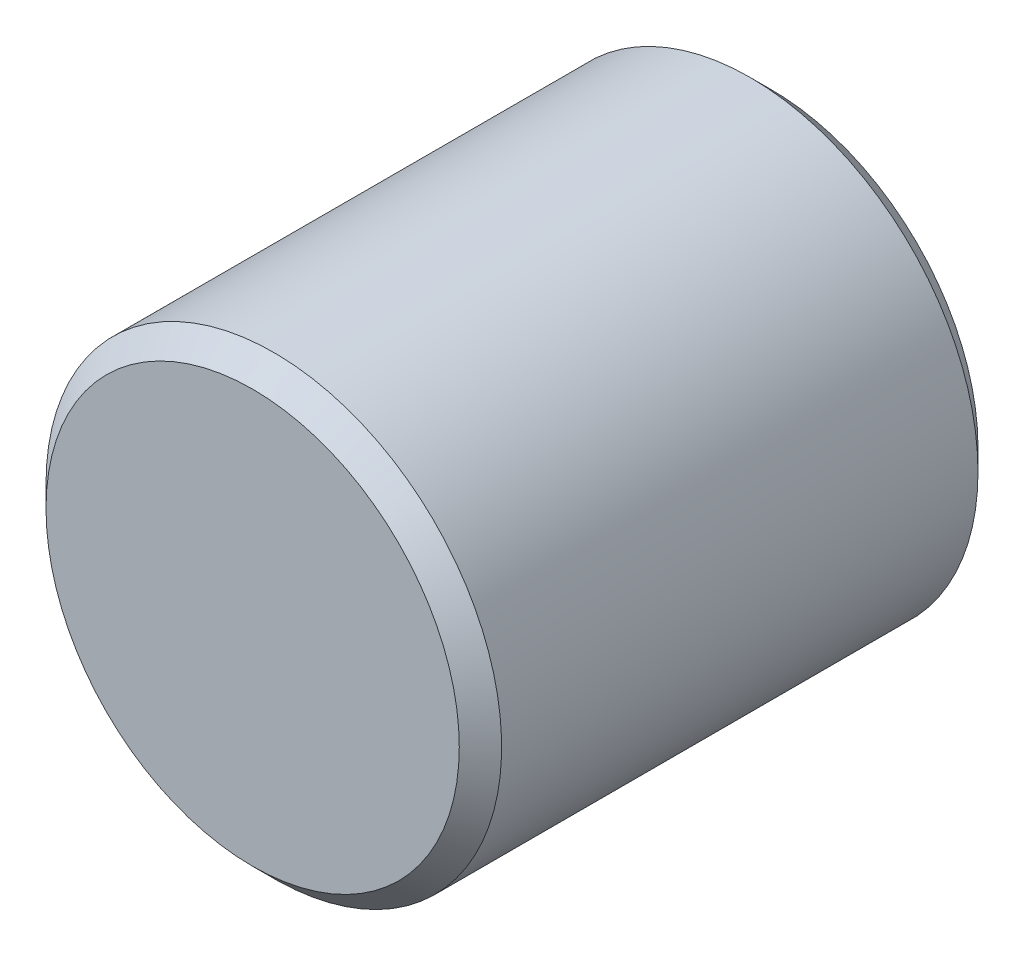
ISO-10303-21;
HEADER;
FILE_DESCRIPTION(('STEP AP214'),'2;1');
FILE_NAME('part.step','',(''),(''),'','','');
FILE_SCHEMA(('AUTOMOTIVE_DESIGN { 1 0 10303 214 1 1 1 1 }'));
ENDSEC;
DATA;
#1=APPLICATION_CONTEXT('core data for automotive mechanical design processes');
#2=APPLICATION_PROTOCOL_DEFINITION('international standard','automotive_design',2000,#1);
#3=PRODUCT_CONTEXT('',#1,'mechanical');
#4=PRODUCT('Part','Part','',(#3));
#5=PRODUCT_RELATED_PRODUCT_CATEGORY('part','',(#4));
#6=PRODUCT_DEFINITION_FORMATION('','',#4);
#7=PRODUCT_DEFINITION_CONTEXT('part definition',#1,'design');
#8=PRODUCT_DEFINITION('design','',#6,#7);
#9=PRODUCT_DEFINITION_SHAPE('','',#8);
#10=(LENGTH_UNIT() NAMED_UNIT(*) SI_UNIT(.MILLI.,.METRE.));
#11=(NAMED_UNIT(*) PLANE_ANGLE_UNIT() SI_UNIT($,.RADIAN.));
#12=(NAMED_UNIT(*) SI_UNIT($,.STERADIAN.) SOLID_ANGLE_UNIT());
#13=UNCERTAINTY_MEASURE_WITH_UNIT(LENGTH_MEASURE(1.E-05),#10,'distance_accuracy_value','');
#14=(GEOMETRIC_REPRESENTATION_CONTEXT(3) GLOBAL_UNCERTAINTY_ASSIGNED_CONTEXT((#13)) GLOBAL_UNIT_ASSIGNED_CONTEXT((#10,
#11,#12)) REPRESENTATION_CONTEXT('',''));
#15=CARTESIAN_POINT('',(0.,0.,0.));
#16=DIRECTION('',(0.,0.,1.));
#17=DIRECTION('',(1.,0.,0.));
#18=AXIS2_PLACEMENT_3D('',#15,#16,#17);
#19=CARTESIAN_POINT('',(0.,0.,15.5575));
#20=DIRECTION('',(0.,0.,-1.));
#21=DIRECTION('',(-1.,0.,0.));
#22=AXIS2_PLACEMENT_3D('',#19,#20,#21);
#23=CYLINDRICAL_SURFACE('',#22,6.8326);
#24=CARTESIAN_POINT('',(0.,0.,0.635000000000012));
#25=DIRECTION('',(0.,0.,1.));
#26=DIRECTION('',(1.,0.,0.));
#27=AXIS2_PLACEMENT_3D('',#24,#25,#26);
#28=CIRCLE('',#27,6.8326);
#29=CARTESIAN_POINT('',(-6.8326,0.,0.635000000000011));
#30=VERTEX_POINT('',#29);
#31=EDGE_CURVE('E43',#30,#30,#28,.T.);
#32=CARTESIAN_POINT('',(0.,0.,14.9225));
#33=DIRECTION('',(0.,0.,1.));
#34=DIRECTION('',(1.,0.,0.));
#35=AXIS2_PLACEMENT_3D('',#32,#33,#34);
#36=CIRCLE('',#35,6.8326);
#37=CARTESIAN_POINT('',(-6.8326,0.,14.9225));
#38=VERTEX_POINT('',#37);
#39=EDGE_CURVE('E47',#38,#38,#36,.F.);
#40=CARTESIAN_POINT('',(-6.8326,0.,0.635000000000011));
#41=CARTESIAN_POINT('',(-6.8326,0.,0.783828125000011));
#42=CARTESIAN_POINT('',(-6.8326,0.,0.932656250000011));
#43=CARTESIAN_POINT('',(-6.8326,0.,1.23031250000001));
#44=CARTESIAN_POINT('',(-6.8326,0.,1.37914062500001));
#45=CARTESIAN_POINT('',(-6.8326,0.,1.67679687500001));
#46=CARTESIAN_POINT('',(-6.8326,0.,1.82562500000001));
#47=CARTESIAN_POINT('',(-6.8326,0.,2.12328125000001));
#48=CARTESIAN_POINT('',(-6.8326,0.,2.27210937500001));
#49=CARTESIAN_POINT('',(-6.8326,0.,2.56976562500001));
#50=CARTESIAN_POINT('',(-6.8326,0.,2.71859375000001));
#51=CARTESIAN_POINT('',(-6.8326,0.,3.01625000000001));
#52=CARTESIAN_POINT('',(-6.8326,0.,3.16507812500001));
#53=CARTESIAN_POINT('',(-6.8326,0.,3.46273437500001));
#54=CARTESIAN_POINT('',(-6.8326,0.,3.61156250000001));
#55=CARTESIAN_POINT('',(-6.8326,0.,3.90921875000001));
#56=CARTESIAN_POINT('',(-6.8326,0.,4.05804687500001));
#57=CARTESIAN_POINT('',(-6.8326,0.,4.35570312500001));
#58=CARTESIAN_POINT('',(-6.8326,0.,4.50453125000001));
#59=CARTESIAN_POINT('',(-6.8326,0.,4.80218750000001));
#60=CARTESIAN_POINT('',(-6.8326,0.,4.95101562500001));
#61=CARTESIAN_POINT('',(-6.8326,0.,5.24867187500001));
#62=CARTESIAN_POINT('',(-6.8326,0.,5.39750000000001));
#63=CARTESIAN_POINT('',(-6.8326,0.,5.69515625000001));
#64=CARTESIAN_POINT('',(-6.8326,0.,5.84398437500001));
#65=CARTESIAN_POINT('',(-6.8326,0.,6.14164062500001));
#66=CARTESIAN_POINT('',(-6.8326,0.,6.29046875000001));
#67=CARTESIAN_POINT('',(-6.8326,0.,6.58812500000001));
#68=CARTESIAN_POINT('',(-6.8326,0.,6.73695312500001));
#69=CARTESIAN_POINT('',(-6.8326,0.,7.03460937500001));
#70=CARTESIAN_POINT('',(-6.8326,0.,7.18343750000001));
#71=CARTESIAN_POINT('',(-6.8326,0.,7.48109375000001));
#72=CARTESIAN_POINT('',(-6.8326,0.,7.62992187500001));
#73=CARTESIAN_POINT('',(-6.8326,0.,7.92757812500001));
#74=CARTESIAN_POINT('',(-6.8326,0.,8.07640625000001));
#75=CARTESIAN_POINT('',(-6.8326,0.,8.37406250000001));
#76=CARTESIAN_POINT('',(-6.8326,0.,8.52289062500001));
#77=CARTESIAN_POINT('',(-6.8326,0.,8.82054687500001));
#78=CARTESIAN_POINT('',(-6.8326,0.,8.96937500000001));
#79=CARTESIAN_POINT('',(-6.8326,0.,9.26703125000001));
#80=CARTESIAN_POINT('',(-6.8326,0.,9.41585937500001));
#81=CARTESIAN_POINT('',(-6.8326,0.,9.71351562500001));
#82=CARTESIAN_POINT('',(-6.8326,0.,9.86234375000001));
#83=CARTESIAN_POINT('',(-6.8326,0.,10.16));
#84=CARTESIAN_POINT('',(-6.8326,0.,10.308828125));
#85=CARTESIAN_POINT('',(-6.8326,0.,10.606484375));
#86=CARTESIAN_POINT('',(-6.8326,0.,10.7553125));
#87=CARTESIAN_POINT('',(-6.8326,0.,11.05296875));
#88=CARTESIAN_POINT('',(-6.8326,0.,11.201796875));
#89=CARTESIAN_POINT('',(-6.8326,0.,11.499453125));
#90=CARTESIAN_POINT('',(-6.8326,0.,11.64828125));
#91=CARTESIAN_POINT('',(-6.8326,0.,11.9459375));
#92=CARTESIAN_POINT('',(-6.8326,0.,12.094765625));
#93=CARTESIAN_POINT('',(-6.8326,0.,12.392421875));
#94=CARTESIAN_POINT('',(-6.8326,0.,12.54125));
#95=CARTESIAN_POINT('',(-6.8326,0.,12.83890625));
#96=CARTESIAN_POINT('',(-6.8326,0.,12.987734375));
#97=CARTESIAN_POINT('',(-6.8326,0.,13.285390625));
#98=CARTESIAN_POINT('',(-6.8326,0.,13.43421875));
#99=CARTESIAN_POINT('',(-6.8326,0.,13.731875));
#100=CARTESIAN_POINT('',(-6.8326,0.,13.880703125));
#101=CARTESIAN_POINT('',(-6.8326,0.,14.178359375));
#102=CARTESIAN_POINT('',(-6.8326,0.,14.3271875));
#103=CARTESIAN_POINT('',(-6.8326,0.,14.62484375));
#104=CARTESIAN_POINT('',(-6.8326,0.,14.773671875));
#105=CARTESIAN_POINT('',(-6.8326,0.,14.9225));
#106=B_SPLINE_CURVE_WITH_KNOTS('',3,(#40,#41,#42,#43,#44,#45,#46,#47,#48,#49,#50,#51,#52,#53,
#54,#55,#56,#57,#58,#59,#60,#61,#62,#63,#64,#65,#66,#67,#68,#69,#70,#71,#72,#73,#74,#75,#76,#77,
#78,#79,#80,#81,#82,#83,#84,#85,#86,#87,#88,#89,#90,#91,#92,#93,#94,#95,#96,#97,#98,#99,#100,
#101,#102,#103,#104,#105),.UNSPECIFIED.,.F.,.F.,(4,2,2,2,2,2,2,2,2,2,2,2,2,2,2,2,2,2,2,2,2,2,2,
2,2,2,2,2,2,2,2,2,4),(0.,0.446484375,0.892968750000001,1.339453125,1.7859375,2.232421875,
2.67890625,3.125390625,3.571875,4.018359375,4.46484375,4.911328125,5.3578125,5.804296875,
6.25078125,6.697265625,7.14375,7.590234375,8.03671875,8.483203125,8.9296875,9.376171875,
9.82265625,10.269140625,10.715625,11.162109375,11.60859375,12.055078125,12.5015625,12.948046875,
13.39453125,13.841015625,14.2875),.UNSPECIFIED.);
#107=EDGE_CURVE('BSEAM32',#30,#38,#106,.T.);
#108=ORIENTED_EDGE('',*,*,#31,.T.);
#109=ORIENTED_EDGE('',*,*,#39,.T.);
#110=ORIENTED_EDGE('',*,*,#107,.T.);
#111=ORIENTED_EDGE('',*,*,#107,.F.);
#112=EDGE_LOOP('',(#108,#110,#109,#111));
#113=FACE_BOUND('',#112,.T.);
#114=ADVANCED_FACE('F32',(#113),#23,.T.);
#115=CARTESIAN_POINT('',(0.,0.,15.5575));
#116=DIRECTION('',(0.,0.,1.));
#117=DIRECTION('',(1.,0.,0.));
#118=AXIS2_PLACEMENT_3D('',#115,#116,#117);
#119=PLANE('',#118);
#120=CARTESIAN_POINT('',(0.,0.,15.5575));
#121=DIRECTION('',(0.,0.,1.));
#122=DIRECTION('',(1.,0.,0.));
#123=AXIS2_PLACEMENT_3D('',#120,#121,#122);
#124=CIRCLE('',#123,6.19760000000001);
#125=CARTESIAN_POINT('',(6.19760000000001,0.,15.5575));
#126=VERTEX_POINT('',#125);
#127=EDGE_CURVE('E10',#126,#126,#124,.T.);
#128=ORIENTED_EDGE('',*,*,#127,.T.);
#129=EDGE_LOOP('',(#128));
#130=FACE_BOUND('',#129,.T.);
#131=ADVANCED_FACE('F63',(#130),#119,.T.);
#132=CARTESIAN_POINT('',(0.,0.,0.));
#133=DIRECTION('',(0.,0.,1.));
#134=DIRECTION('',(1.,0.,0.));
#135=AXIS2_PLACEMENT_3D('',#132,#133,#134);
#136=PLANE('',#135);
#137=CARTESIAN_POINT('',(0.,0.,0.));
#138=DIRECTION('',(0.,0.,1.));
#139=DIRECTION('',(1.,0.,0.));
#140=AXIS2_PLACEMENT_3D('',#137,#138,#139);
#141=CIRCLE('',#140,6.19759999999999);
#142=CARTESIAN_POINT('',(6.19759999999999,0.,0.));
#143=VERTEX_POINT('',#142);
#144=EDGE_CURVE('E39',#143,#143,#141,.F.);
#145=ORIENTED_EDGE('',*,*,#144,.T.);
#146=EDGE_LOOP('',(#145));
#147=FACE_BOUND('',#146,.T.);
#148=ADVANCED_FACE('F60',(#147),#136,.F.);
#149=CARTESIAN_POINT('',(0.,0.,0.635000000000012));
#150=DIRECTION('',(0.,0.,1.));
#151=DIRECTION('',(1.,0.,0.));
#152=AXIS2_PLACEMENT_3D('',#149,#150,#151);
#153=CONICAL_SURFACE('',#152,6.8326,0.785398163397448);
#154=ORIENTED_EDGE('',*,*,#144,.F.);
#155=EDGE_LOOP('',(#154));
#156=FACE_BOUND('',#155,.T.);
#157=ORIENTED_EDGE('',*,*,#31,.F.);
#158=EDGE_LOOP('',(#157));
#159=FACE_BOUND('',#158,.T.);
#160=ADVANCED_FACE('F56',(#156,#159),#153,.T.);
#161=CARTESIAN_POINT('',(0.,0.,15.5575));
#162=DIRECTION('',(0.,0.,-1.));
#163=DIRECTION('',(-1.,0.,0.));
#164=AXIS2_PLACEMENT_3D('',#161,#162,#163);
#165=CONICAL_SURFACE('',#164,6.19760000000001,0.785398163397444);
#166=ORIENTED_EDGE('',*,*,#39,.F.);
#167=EDGE_LOOP('',(#166));
#168=FACE_BOUND('',#167,.T.);
#169=ORIENTED_EDGE('',*,*,#127,.F.);
#170=EDGE_LOOP('',(#169));
#171=FACE_BOUND('',#170,.T.);
#172=ADVANCED_FACE('F34',(#168,#171),#165,.T.);
#173=CLOSED_SHELL('',(#114,#131,#148,#160,#172));
#174=MANIFOLD_SOLID_BREP('B2',#173);
#175=ADVANCED_BREP_SHAPE_REPRESENTATION('',(#18,#174),#14);
#176=SHAPE_DEFINITION_REPRESENTATION(#9,#175);
ENDSEC;
END-ISO-10303-21;
